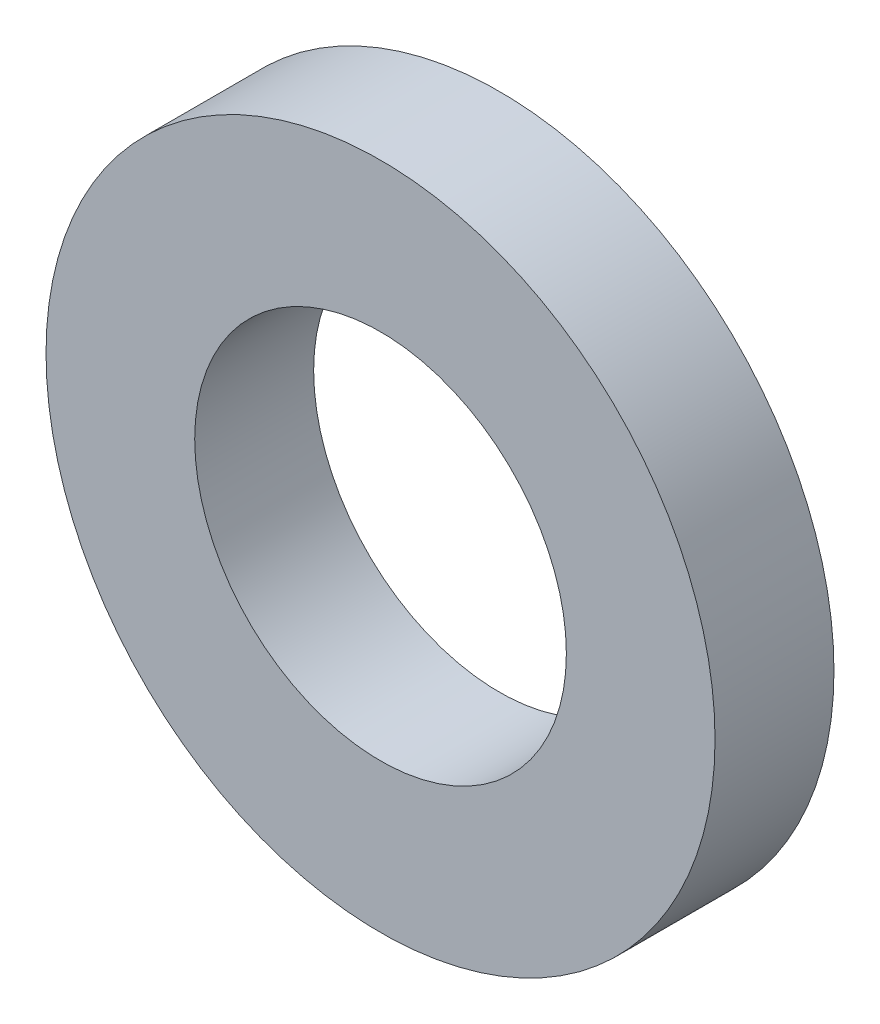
ISO-10303-21;
HEADER;
FILE_DESCRIPTION(('STEP AP214'),'2;1');
FILE_NAME('part.step','',(''),(''),'','','');
FILE_SCHEMA(('AUTOMOTIVE_DESIGN { 1 0 10303 214 1 1 1 1 }'));
ENDSEC;
DATA;
#1=APPLICATION_CONTEXT('core data for automotive mechanical design processes');
#2=APPLICATION_PROTOCOL_DEFINITION('international standard','automotive_design',2000,#1);
#3=PRODUCT_CONTEXT('',#1,'mechanical');
#4=PRODUCT('Part','Part','',(#3));
#5=PRODUCT_RELATED_PRODUCT_CATEGORY('part','',(#4));
#6=PRODUCT_DEFINITION_FORMATION('','',#4);
#7=PRODUCT_DEFINITION_CONTEXT('part definition',#1,'design');
#8=PRODUCT_DEFINITION('design','',#6,#7);
#9=PRODUCT_DEFINITION_SHAPE('','',#8);
#10=(LENGTH_UNIT() NAMED_UNIT(*) SI_UNIT(.MILLI.,.METRE.));
#11=(NAMED_UNIT(*) PLANE_ANGLE_UNIT() SI_UNIT($,.RADIAN.));
#12=(NAMED_UNIT(*) SI_UNIT($,.STERADIAN.) SOLID_ANGLE_UNIT());
#13=UNCERTAINTY_MEASURE_WITH_UNIT(LENGTH_MEASURE(1.E-05),#10,'distance_accuracy_value','');
#14=(GEOMETRIC_REPRESENTATION_CONTEXT(3) GLOBAL_UNCERTAINTY_ASSIGNED_CONTEXT((#13)) GLOBAL_UNIT_ASSIGNED_CONTEXT((#10,
#11,#12)) REPRESENTATION_CONTEXT('',''));
#15=CARTESIAN_POINT('',(0.,0.,0.));
#16=DIRECTION('',(0.,0.,1.));
#17=DIRECTION('',(1.,0.,0.));
#18=AXIS2_PLACEMENT_3D('',#15,#16,#17);
#19=CARTESIAN_POINT('',(0.,0.,2.032));
#20=DIRECTION('',(0.,0.,1.));
#21=DIRECTION('',(1.,0.,0.));
#22=AXIS2_PLACEMENT_3D('',#19,#20,#21);
#23=PLANE('',#22);
#24=CARTESIAN_POINT('',(0.,0.,2.032));
#25=DIRECTION('',(0.,0.,-1.));
#26=DIRECTION('',(-1.,0.,0.));
#27=AXIS2_PLACEMENT_3D('',#24,#25,#26);
#28=CIRCLE('',#27,3.175);
#29=CARTESIAN_POINT('',(-3.175,0.,2.032));
#30=VERTEX_POINT('',#29);
#31=EDGE_CURVE('E26',#30,#30,#28,.T.);
#32=ORIENTED_EDGE('',*,*,#31,.T.);
#33=EDGE_LOOP('',(#32));
#34=FACE_BOUND('',#33,.T.);
#35=CARTESIAN_POINT('',(0.,0.,2.032));
#36=DIRECTION('',(0.,0.,-1.));
#37=DIRECTION('',(-1.,0.,0.));
#38=AXIS2_PLACEMENT_3D('',#35,#36,#37);
#39=CIRCLE('',#38,5.715);
#40=CARTESIAN_POINT('',(-5.715,0.,2.032));
#41=VERTEX_POINT('',#40);
#42=EDGE_CURVE('E8',#41,#41,#39,.T.);
#43=ORIENTED_EDGE('',*,*,#42,.F.);
#44=EDGE_LOOP('',(#43));
#45=FACE_BOUND('',#44,.T.);
#46=ADVANCED_FACE('F12',(#34,#45),#23,.T.);
#47=CARTESIAN_POINT('',(0.,0.,0.));
#48=DIRECTION('',(0.,0.,-1.));
#49=DIRECTION('',(-1.,0.,0.));
#50=AXIS2_PLACEMENT_3D('',#47,#48,#49);
#51=PLANE('',#50);
#52=CARTESIAN_POINT('',(0.,0.,0.));
#53=DIRECTION('',(0.,0.,-1.));
#54=DIRECTION('',(-1.,0.,0.));
#55=AXIS2_PLACEMENT_3D('',#52,#53,#54);
#56=CIRCLE('',#55,3.175);
#57=CARTESIAN_POINT('',(-3.175,0.,0.));
#58=VERTEX_POINT('',#57);
#59=EDGE_CURVE('E16',#58,#58,#56,.T.);
#60=ORIENTED_EDGE('',*,*,#59,.F.);
#61=EDGE_LOOP('',(#60));
#62=FACE_BOUND('',#61,.T.);
#63=CARTESIAN_POINT('',(0.,0.,0.));
#64=DIRECTION('',(0.,0.,1.));
#65=DIRECTION('',(1.,0.,0.));
#66=AXIS2_PLACEMENT_3D('',#63,#64,#65);
#67=CIRCLE('',#66,5.715);
#68=CARTESIAN_POINT('',(5.715,0.,0.));
#69=VERTEX_POINT('',#68);
#70=EDGE_CURVE('E20',#69,#69,#67,.T.);
#71=ORIENTED_EDGE('',*,*,#70,.F.);
#72=EDGE_LOOP('',(#71));
#73=FACE_BOUND('',#72,.T.);
#74=ADVANCED_FACE('F36',(#62,#73),#51,.T.);
#75=CARTESIAN_POINT('',(0.,0.,0.));
#76=DIRECTION('',(0.,0.,1.));
#77=DIRECTION('',(1.,0.,0.));
#78=AXIS2_PLACEMENT_3D('',#75,#76,#77);
#79=CYLINDRICAL_SURFACE('',#78,5.715);
#80=ORIENTED_EDGE('',*,*,#42,.T.);
#81=EDGE_LOOP('',(#80));
#82=FACE_BOUND('',#81,.T.);
#83=ORIENTED_EDGE('',*,*,#70,.T.);
#84=EDGE_LOOP('',(#83));
#85=FACE_BOUND('',#84,.T.);
#86=ADVANCED_FACE('F14',(#82,#85),#79,.T.);
#87=CARTESIAN_POINT('',(0.,0.,2.032));
#88=DIRECTION('',(0.,0.,-1.));
#89=DIRECTION('',(-1.,0.,0.));
#90=AXIS2_PLACEMENT_3D('',#87,#88,#89);
#91=CYLINDRICAL_SURFACE('',#90,3.175);
#92=ORIENTED_EDGE('',*,*,#59,.T.);
#93=EDGE_LOOP('',(#92));
#94=FACE_BOUND('',#93,.T.);
#95=ORIENTED_EDGE('',*,*,#31,.F.);
#96=EDGE_LOOP('',(#95));
#97=FACE_BOUND('',#96,.T.);
#98=ADVANCED_FACE('F33',(#94,#97),#91,.F.);
#99=CLOSED_SHELL('',(#46,#74,#86,#98));
#100=MANIFOLD_SOLID_BREP('B1',#99);
#101=ADVANCED_BREP_SHAPE_REPRESENTATION('',(#18,#100),#14);
#102=SHAPE_DEFINITION_REPRESENTATION(#9,#101);
ENDSEC;
END-ISO-10303-21;
